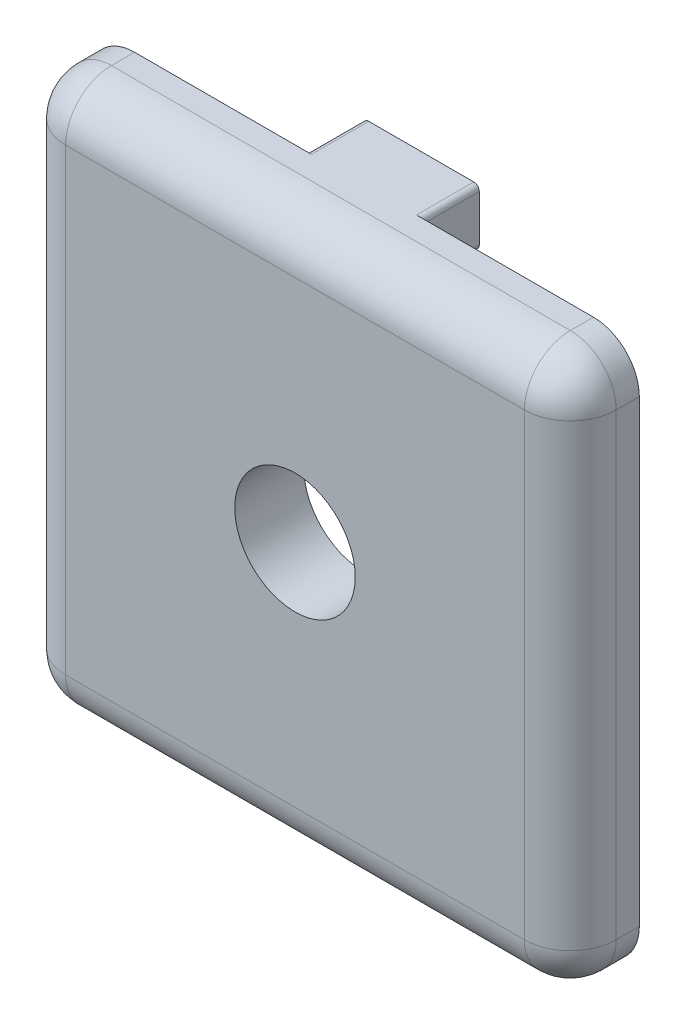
from build123d import *

# Parameters (mm, degrees)
SKETCH1_R      = 4.1671875
EXTRUDE1_DEPTH = 4.7752
FILLET1_R      = 3.175
EXTRUDE2_DEPTH = 3.9624


with BuildPart() as part:
    # Sketch1 → Extrude1 (new body)
    with BuildSketch(Plane.XY):
        with BuildLine():
            Line((-15.875, 19.05), (15.875, 19.05))
            ThreePointArc((15.875, 19.05), (18.12006403, 18.12006403), (19.05, 15.875))
            Line((19.05, 15.875), (19.05, -15.875))
            ThreePointArc((19.05, -15.875), (18.12006403, -18.12006403), (15.875, -19.05))
            Line((15.875, -19.05), (-15.875, -19.05))
            ThreePointArc((-15.875, -19.05), (-18.12006403, -18.12006403), (-19.05, -15.875))
            Line((-19.05, -15.875), (-19.05, 15.875))
            ThreePointArc((-19.05, 15.875), (-18.12006403, 18.12006403), (-15.875, 19.05))
        make_face()
        Circle(SKETCH1_R, mode=Mode.SUBTRACT)
    extrude(amount=EXTRUDE1_DEPTH)

    # Fillet1
    fillet1_edges = [part.edges().sort_by_distance(p)[0] for p in [
        (-18.12006403, -18.12006403, 4.7752),
        (0, -19.05, 4.7752),
        (18.12006403, -18.12006403, 4.7752),
        (19.05, 0, 4.7752),
        (18.12006403, 18.12006403, 4.7752),
        (0, 19.05, 4.7752),
        (-18.12006403, 18.12006403, 4.7752),
        (-19.05, 0, 4.7752),
    ]]
    fillet(fillet1_edges, radius=FILLET1_R)

    # Sketch2 → Extrude2 (add)
    with BuildSketch(Plane(origin=(0, 0, 0), x_dir=(-1, 0, 0), z_dir=(0, 0, -1))):
        with BuildLine():
            Line((-3.6322, 19.05), (3.6322, 19.05))
            ThreePointArc((3.6322, 19.05), (3.901607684, 18.938407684), (4.0132, 18.669))
            Line((4.0132, 18.669), (4.0132, 15.4686))
            ThreePointArc((4.0132, 15.4686), (3.901607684, 15.199192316), (3.6322, 15.0876))
            Line((3.6322, 15.0876), (-3.6322, 15.0876))
            ThreePointArc((-3.6322, 15.0876), (-3.901607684, 15.199192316), (-4.0132, 15.4686))
            Line((-4.0132, 15.4686), (-4.0132, 18.669))
            ThreePointArc((-4.0132, 18.669), (-3.901607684, 18.938407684), (-3.6322, 19.05))
        make_face()
    extrude(amount=EXTRUDE2_DEPTH)


solid = part.part
